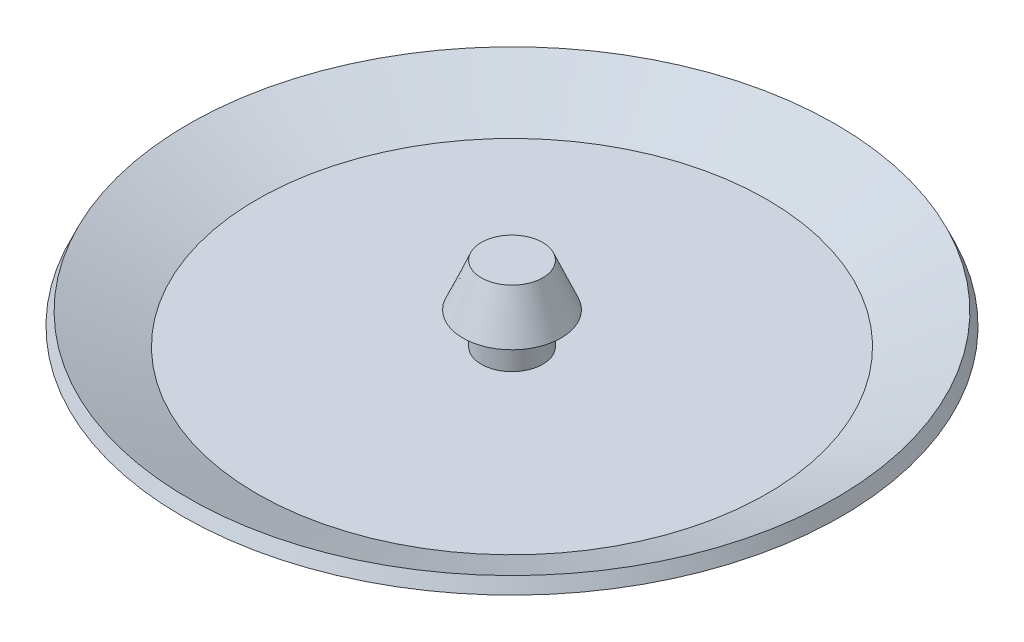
ISO-10303-21;
HEADER;
FILE_DESCRIPTION(('STEP AP214'),'2;1');
FILE_NAME('part.step','',(''),(''),'','','');
FILE_SCHEMA(('AUTOMOTIVE_DESIGN { 1 0 10303 214 1 1 1 1 }'));
ENDSEC;
DATA;
#1=APPLICATION_CONTEXT('core data for automotive mechanical design processes');
#2=APPLICATION_PROTOCOL_DEFINITION('international standard','automotive_design',2000,#1);
#3=PRODUCT_CONTEXT('',#1,'mechanical');
#4=PRODUCT('Part','Part','',(#3));
#5=PRODUCT_RELATED_PRODUCT_CATEGORY('part','',(#4));
#6=PRODUCT_DEFINITION_FORMATION('','',#4);
#7=PRODUCT_DEFINITION_CONTEXT('part definition',#1,'design');
#8=PRODUCT_DEFINITION('design','',#6,#7);
#9=PRODUCT_DEFINITION_SHAPE('','',#8);
#10=(LENGTH_UNIT() NAMED_UNIT(*) SI_UNIT(.MILLI.,.METRE.));
#11=(NAMED_UNIT(*) PLANE_ANGLE_UNIT() SI_UNIT($,.RADIAN.));
#12=(NAMED_UNIT(*) SI_UNIT($,.STERADIAN.) SOLID_ANGLE_UNIT());
#13=UNCERTAINTY_MEASURE_WITH_UNIT(LENGTH_MEASURE(1.E-05),#10,'distance_accuracy_value','');
#14=(GEOMETRIC_REPRESENTATION_CONTEXT(3) GLOBAL_UNCERTAINTY_ASSIGNED_CONTEXT((#13)) GLOBAL_UNIT_ASSIGNED_CONTEXT((#10,
#11,#12)) REPRESENTATION_CONTEXT('',''));
#15=CARTESIAN_POINT('',(0.,0.,0.));
#16=DIRECTION('',(0.,0.,1.));
#17=DIRECTION('',(1.,0.,0.));
#18=AXIS2_PLACEMENT_3D('',#15,#16,#17);
#19=CARTESIAN_POINT('',(10.795,0.,0.));
#20=DIRECTION('',(0.,1.,0.));
#21=DIRECTION('',(0.,0.,1.));
#22=AXIS2_PLACEMENT_3D('',#19,#20,#21);
#23=PLANE('',#22);
#24=CARTESIAN_POINT('',(0.,0.,0.));
#25=DIRECTION('',(0.,-1.,0.));
#26=DIRECTION('',(0.,0.,-1.));
#27=AXIS2_PLACEMENT_3D('',#24,#25,#26);
#28=CIRCLE('',#27,10.795);
#29=CARTESIAN_POINT('',(0.,0.,-10.795));
#30=VERTEX_POINT('',#29);
#31=EDGE_CURVE('E54',#30,#30,#28,.T.);
#32=ORIENTED_EDGE('',*,*,#31,.T.);
#33=EDGE_LOOP('',(#32));
#34=FACE_BOUND('',#33,.T.);
#35=ADVANCED_FACE('F26',(#34),#23,.F.);
#36=CARTESIAN_POINT('',(0.,3.6322,0.));
#37=DIRECTION('',(0.,-1.,0.));
#38=DIRECTION('',(0.,0.,-1.));
#39=AXIS2_PLACEMENT_3D('',#36,#37,#38);
#40=CONICAL_SURFACE('',#39,1.27,0.404891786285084);
#41=CARTESIAN_POINT('',(0.,1.8542,0.));
#42=DIRECTION('',(0.,-1.,0.));
#43=DIRECTION('',(0.,0.,-1.));
#44=AXIS2_PLACEMENT_3D('',#41,#42,#43);
#45=CIRCLE('',#44,2.032);
#46=CARTESIAN_POINT('',(0.,1.8542,-2.032));
#47=VERTEX_POINT('',#46);
#48=EDGE_CURVE('E32',#47,#47,#45,.T.);
#49=ORIENTED_EDGE('',*,*,#48,.F.);
#50=EDGE_LOOP('',(#49));
#51=FACE_BOUND('',#50,.T.);
#52=CARTESIAN_POINT('',(0.,3.6322,0.));
#53=DIRECTION('',(0.,-1.,0.));
#54=DIRECTION('',(0.,0.,-1.));
#55=AXIS2_PLACEMENT_3D('',#52,#53,#54);
#56=CIRCLE('',#55,1.27);
#57=CARTESIAN_POINT('',(0.,3.6322,-1.27));
#58=VERTEX_POINT('',#57);
#59=EDGE_CURVE('E10',#58,#58,#56,.T.);
#60=ORIENTED_EDGE('',*,*,#59,.T.);
#61=EDGE_LOOP('',(#60));
#62=FACE_BOUND('',#61,.T.);
#63=ADVANCED_FACE('F92',(#51,#62),#40,.T.);
#64=CARTESIAN_POINT('',(2.032,1.8542,0.));
#65=DIRECTION('',(0.,1.,0.));
#66=DIRECTION('',(0.,0.,1.));
#67=AXIS2_PLACEMENT_3D('',#64,#65,#66);
#68=PLANE('',#67);
#69=CARTESIAN_POINT('',(0.,1.8542,0.));
#70=DIRECTION('',(0.,-1.,0.));
#71=DIRECTION('',(0.,0.,-1.));
#72=AXIS2_PLACEMENT_3D('',#69,#70,#71);
#73=CIRCLE('',#72,1.27);
#74=CARTESIAN_POINT('',(0.,1.8542,-1.27));
#75=VERTEX_POINT('',#74);
#76=EDGE_CURVE('E36',#75,#75,#73,.T.);
#77=ORIENTED_EDGE('',*,*,#76,.F.);
#78=EDGE_LOOP('',(#77));
#79=FACE_BOUND('',#78,.T.);
#80=ORIENTED_EDGE('',*,*,#48,.T.);
#81=EDGE_LOOP('',(#80));
#82=FACE_BOUND('',#81,.T.);
#83=ADVANCED_FACE('F87',(#79,#82),#68,.F.);
#84=CARTESIAN_POINT('',(0.,0.,0.));
#85=DIRECTION('',(0.,-1.,0.));
#86=DIRECTION('',(0.,0.,-1.));
#87=AXIS2_PLACEMENT_3D('',#84,#85,#86);
#88=CYLINDRICAL_SURFACE('',#87,1.27);
#89=CARTESIAN_POINT('',(0.,0.531702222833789,0.));
#90=DIRECTION('',(0.,-1.,0.));
#91=DIRECTION('',(0.,0.,-1.));
#92=AXIS2_PLACEMENT_3D('',#89,#90,#91);
#93=CIRCLE('',#92,1.27);
#94=CARTESIAN_POINT('',(0.,0.531702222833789,-1.27));
#95=VERTEX_POINT('',#94);
#96=EDGE_CURVE('E40',#95,#95,#93,.T.);
#97=ORIENTED_EDGE('',*,*,#96,.F.);
#98=EDGE_LOOP('',(#97));
#99=FACE_BOUND('',#98,.T.);
#100=ORIENTED_EDGE('',*,*,#76,.T.);
#101=EDGE_LOOP('',(#100));
#102=FACE_BOUND('',#101,.T.);
#103=ADVANCED_FACE('F81',(#99,#102),#88,.T.);
#104=CARTESIAN_POINT('',(1.27,0.531702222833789,0.));
#105=DIRECTION('',(0.,-1.,0.));
#106=DIRECTION('',(0.,0.,-1.));
#107=AXIS2_PLACEMENT_3D('',#104,#105,#106);
#108=PLANE('',#107);
#109=CARTESIAN_POINT('',(0.,0.531702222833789,0.));
#110=DIRECTION('',(0.,-1.,0.));
#111=DIRECTION('',(0.,0.,-1.));
#112=AXIS2_PLACEMENT_3D('',#109,#110,#111);
#113=CIRCLE('',#112,10.5529177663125);
#114=CARTESIAN_POINT('',(0.,0.531702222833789,-10.5529177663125));
#115=VERTEX_POINT('',#114);
#116=EDGE_CURVE('E45',#115,#115,#113,.T.);
#117=ORIENTED_EDGE('',*,*,#116,.F.);
#118=EDGE_LOOP('',(#117));
#119=FACE_BOUND('',#118,.T.);
#120=ORIENTED_EDGE('',*,*,#96,.T.);
#121=EDGE_LOOP('',(#120));
#122=FACE_BOUND('',#121,.T.);
#123=ADVANCED_FACE('F75',(#119,#122),#108,.F.);
#124=CARTESIAN_POINT('',(0.,0.531702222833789,0.));
#125=DIRECTION('',(0.,1.,0.));
#126=DIRECTION('',(0.,0.,1.));
#127=AXIS2_PLACEMENT_3D('',#124,#125,#126);
#128=CONICAL_SURFACE('',#127,10.5529177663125,1.1514688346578);
#129=CARTESIAN_POINT('',(0.,1.80170222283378,0.));
#130=DIRECTION('',(0.,-1.,0.));
#131=DIRECTION('',(0.,0.,-1.));
#132=AXIS2_PLACEMENT_3D('',#129,#130,#131);
#133=CIRCLE('',#132,13.4019451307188);
#134=CARTESIAN_POINT('',(0.,1.80170222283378,-13.4019451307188));
#135=VERTEX_POINT('',#134);
#136=EDGE_CURVE('E48',#135,#135,#133,.T.);
#137=ORIENTED_EDGE('',*,*,#136,.F.);
#138=EDGE_LOOP('',(#137));
#139=FACE_BOUND('',#138,.T.);
#140=ORIENTED_EDGE('',*,*,#116,.T.);
#141=EDGE_LOOP('',(#140));
#142=FACE_BOUND('',#141,.T.);
#143=ADVANCED_FACE('F69',(#139,#142),#128,.F.);
#144=CARTESIAN_POINT('',(0.,1.80170222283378,0.));
#145=DIRECTION('',(0.,-1.,0.));
#146=DIRECTION('',(0.,0.,-1.));
#147=AXIS2_PLACEMENT_3D('',#144,#145,#146);
#148=CONICAL_SURFACE('',#147,13.4019451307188,0.419327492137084);
#149=CARTESIAN_POINT('',(0.,1.26811558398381,0.));
#150=DIRECTION('',(0.,-1.,0.));
#151=DIRECTION('',(0.,0.,-1.));
#152=AXIS2_PLACEMENT_3D('',#149,#150,#151);
#153=CIRCLE('',#152,13.6398);
#154=CARTESIAN_POINT('',(0.,1.26811558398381,-13.6398));
#155=VERTEX_POINT('',#154);
#156=EDGE_CURVE('E51',#155,#155,#153,.T.);
#157=ORIENTED_EDGE('',*,*,#156,.F.);
#158=EDGE_LOOP('',(#157));
#159=FACE_BOUND('',#158,.T.);
#160=ORIENTED_EDGE('',*,*,#136,.T.);
#161=EDGE_LOOP('',(#160));
#162=FACE_BOUND('',#161,.T.);
#163=ADVANCED_FACE('F63',(#159,#162),#148,.T.);
#164=CARTESIAN_POINT('',(0.,1.26811558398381,0.));
#165=DIRECTION('',(0.,1.,0.));
#166=DIRECTION('',(0.,0.,1.));
#167=AXIS2_PLACEMENT_3D('',#164,#165,#166);
#168=CONICAL_SURFACE('',#167,13.6398,1.1514688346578);
#169=ORIENTED_EDGE('',*,*,#31,.F.);
#170=EDGE_LOOP('',(#169));
#171=FACE_BOUND('',#170,.T.);
#172=ORIENTED_EDGE('',*,*,#156,.T.);
#173=EDGE_LOOP('',(#172));
#174=FACE_BOUND('',#173,.T.);
#175=ADVANCED_FACE('F59',(#171,#174),#168,.T.);
#176=CARTESIAN_POINT('',(1.27,3.6322,-13.6398));
#177=DIRECTION('',(0.,1.,0.));
#178=DIRECTION('',(0.,0.,1.));
#179=AXIS2_PLACEMENT_3D('',#176,#177,#178);
#180=PLANE('',#179);
#181=ORIENTED_EDGE('',*,*,#59,.F.);
#182=EDGE_LOOP('',(#181));
#183=FACE_BOUND('',#182,.T.);
#184=ADVANCED_FACE('F62',(#183),#180,.T.);
#185=CLOSED_SHELL('',(#35,#63,#83,#103,#123,#143,#163,#175,#184));
#186=MANIFOLD_SOLID_BREP('B2',#185);
#187=ADVANCED_BREP_SHAPE_REPRESENTATION('',(#18,#186),#14);
#188=SHAPE_DEFINITION_REPRESENTATION(#9,#187);
ENDSEC;
END-ISO-10303-21;
